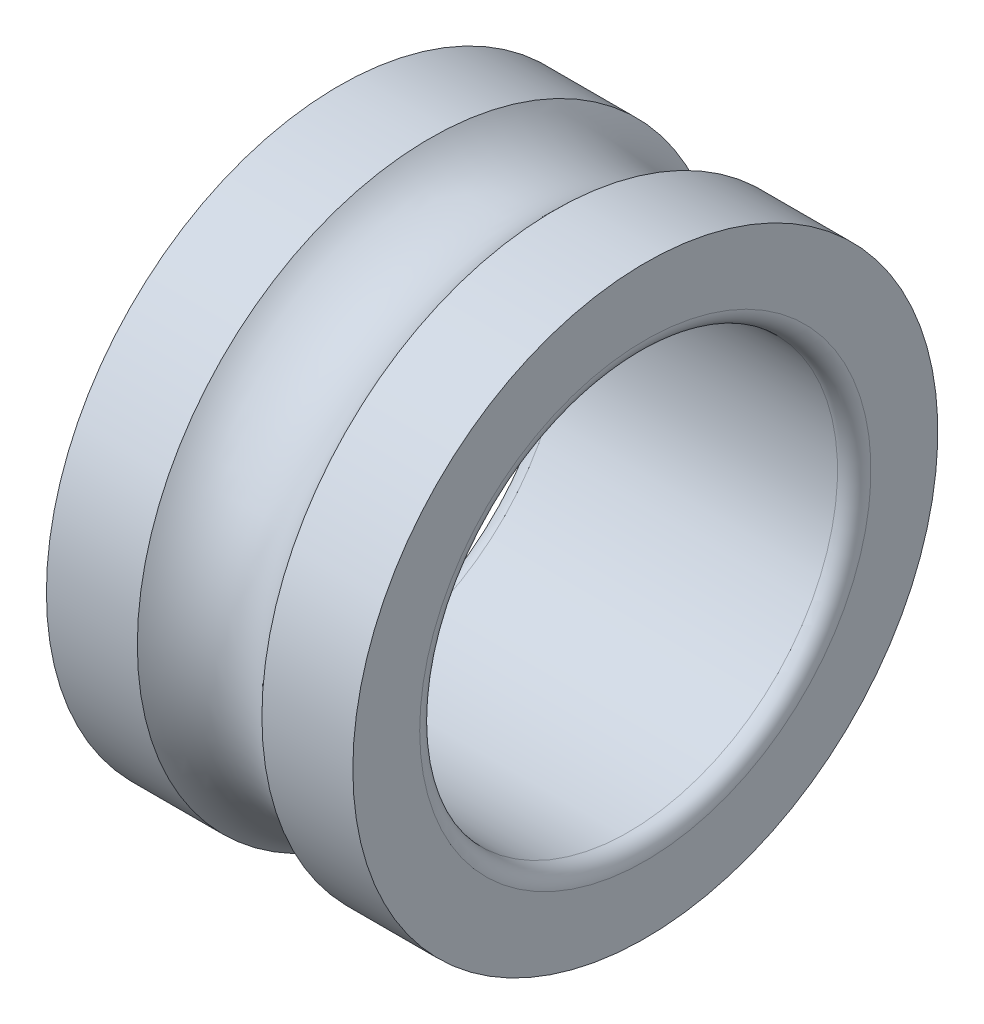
from build123d import *


with BuildPart() as part:
    # Esquisse1 → Base-R_volution (revolve)
    with BuildSketch(Plane(origin=(0, 0, 0), x_dir=(1, 0, 0), z_dir=(0, 1, 0)), mode=Mode.PRIVATE) as base_r_volution_sk:
        with BuildLine():
            Line((0, 10.5), (0, 8.1))
            ThreePointArc((0, 8.1), (0.175735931, 7.675735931), (0.6, 7.5))
            Line((0.6, 7.5), (10.4, 7.5))
            ThreePointArc((10.4, 7.5), (10.824264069, 7.675735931), (11, 8.1))
            Line((11, 8.1), (11, 10.5))
            Line((11, 10.5), (7.736067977, 10.5))
            ThreePointArc((7.736067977, 10.5), (5.5, 9.5), (3.263932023, 10.5))
            Line((3.263932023, 10.5), (0, 10.5))
        make_face()
    revolve(base_r_volution_sk.sketch.rotate(Axis((0, 0, 0), (1, 0, 0)), 180), axis=Axis((0, 0, 0), (1, 0, 0)))


solid = part.part
